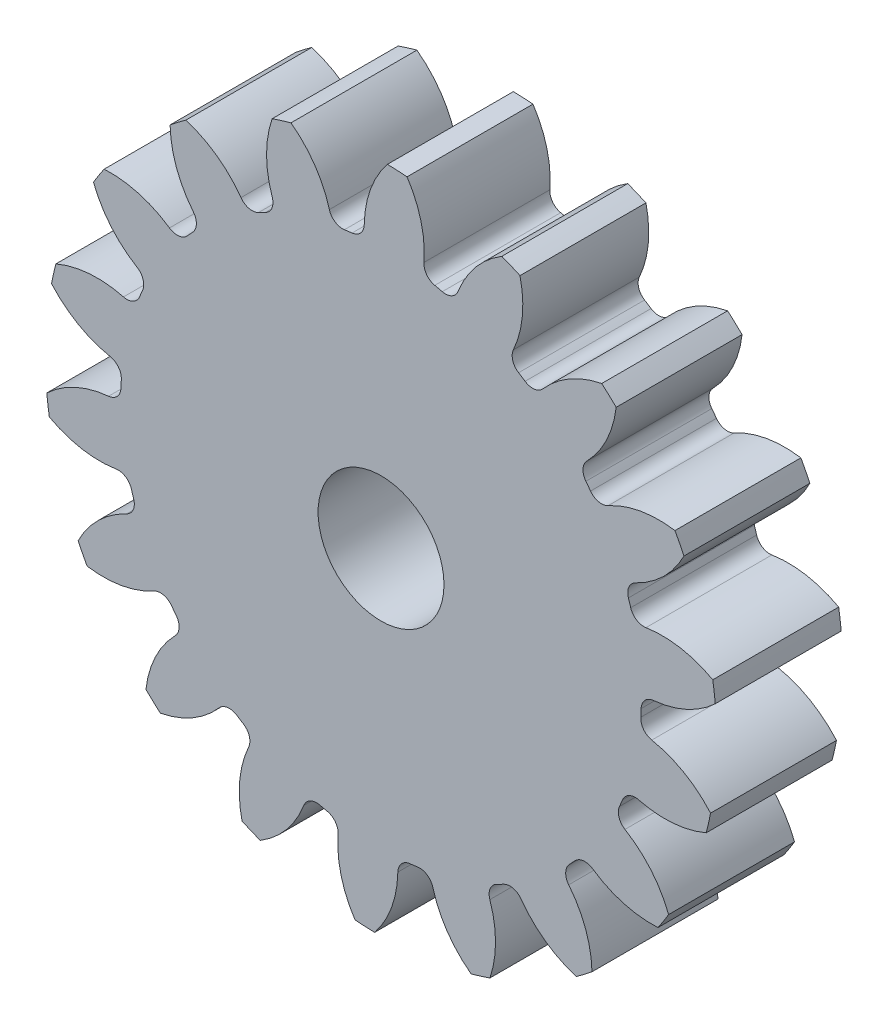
from build123d import *

# Parameters (mm, degrees)
SKETCH3_R         = 338.666666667
GEARBODY_DEPTH    = 127
TOOTHCUT_DEPTH    = 496.498962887
CIRPATTERN1_COUNT = 18
BOREDIA_R         = 63.5
BORE_DEPTH        = 12700


with BuildPart() as part:
    # Sketch3 → gearBody (new body)
    with BuildSketch(Plane.XY):
        Circle(SKETCH3_R)
    extrude(amount=GEARBODY_DEPTH)

    # Sketch2 → toothCut (cut, through all)
    with BuildSketch(Plane.XY):
        with BuildLine():
            ThreePointArc((261.945185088, -16.536962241), (262.161412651, -12.654834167), (262.320108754, -8.769928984))
            ThreePointArc((262.320108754, -8.769928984), (266.047987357, 0.20485799), (274.770763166, 4.489372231))
            ThreePointArc((274.770763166, 4.489372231), (309.281231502, 13.910274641), (338.666666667, 34.311794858))
            ThreePointArc((338.666666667, 34.311794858), (340.004475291, -16.412408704), (333.787238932, -66.771921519))
            ThreePointArc((333.787238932, -66.771921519), (306.503458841, -43.634912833), (273.060843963, -30.933836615))
            ThreePointArc((273.060843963, -30.933836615), (264.791298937, -25.829083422), (261.945185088, -16.536962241))
        make_face()
    toothcut = extrude(amount=TOOTHCUT_DEPTH, mode=Mode.SUBTRACT)

    # CirPattern1: toothCut ×18 about axis
    cirpattern1_axis = Axis((0, 0, 0), (0, 0, 1))
    for i in range(1, CIRPATTERN1_COUNT):
        add(toothcut.rotate(cirpattern1_axis, i * 360 / CIRPATTERN1_COUNT), mode=Mode.SUBTRACT)

    # boreDia → bore (cut, symmetric)
    with BuildSketch(Plane.XY):
        Circle(BOREDIA_R)
    extrude(amount=BORE_DEPTH, both=True, mode=Mode.SUBTRACT)


solid = part.part
